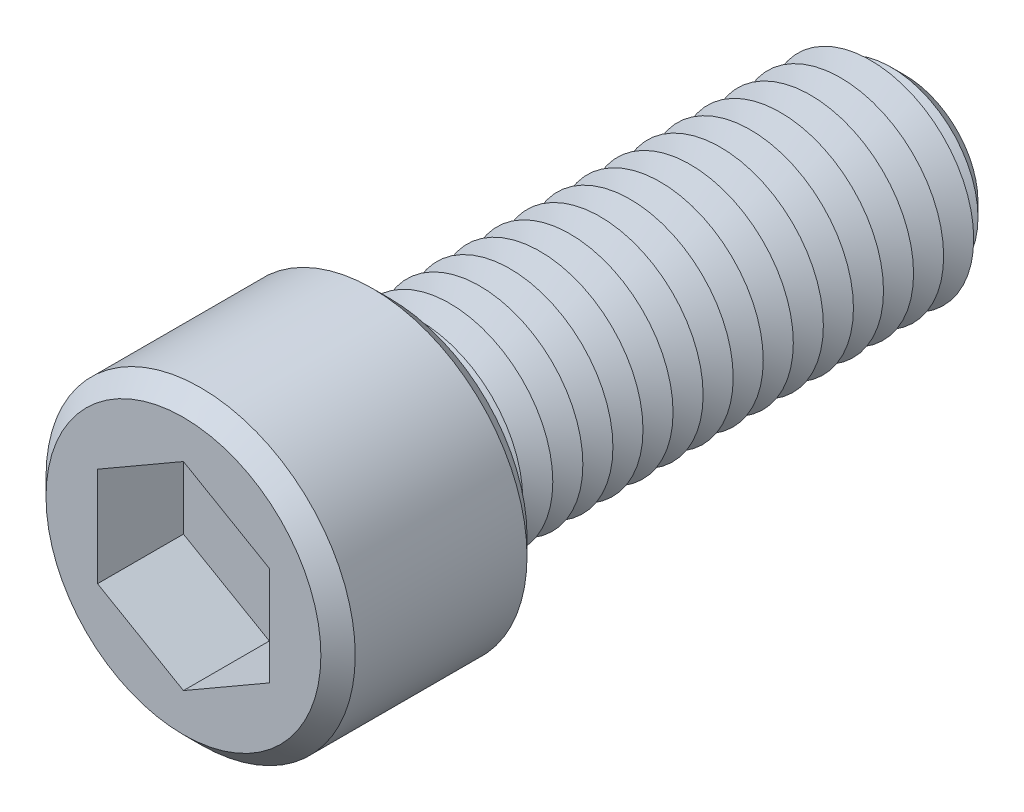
ISO-10303-21;
HEADER;
FILE_DESCRIPTION(('STEP AP214'),'2;1');
FILE_NAME('part.step','',(''),(''),'','','');
FILE_SCHEMA(('AUTOMOTIVE_DESIGN { 1 0 10303 214 1 1 1 1 }'));
ENDSEC;
DATA;
#1=APPLICATION_CONTEXT('core data for automotive mechanical design processes');
#2=APPLICATION_PROTOCOL_DEFINITION('international standard','automotive_design',2000,#1);
#3=PRODUCT_CONTEXT('',#1,'mechanical');
#4=PRODUCT('Part','Part','',(#3));
#5=PRODUCT_RELATED_PRODUCT_CATEGORY('part','',(#4));
#6=PRODUCT_DEFINITION_FORMATION('','',#4);
#7=PRODUCT_DEFINITION_CONTEXT('part definition',#1,'design');
#8=PRODUCT_DEFINITION('design','',#6,#7);
#9=PRODUCT_DEFINITION_SHAPE('','',#8);
#10=(LENGTH_UNIT() NAMED_UNIT(*) SI_UNIT(.MILLI.,.METRE.));
#11=(NAMED_UNIT(*) PLANE_ANGLE_UNIT() SI_UNIT($,.RADIAN.));
#12=(NAMED_UNIT(*) SI_UNIT($,.STERADIAN.) SOLID_ANGLE_UNIT());
#13=UNCERTAINTY_MEASURE_WITH_UNIT(LENGTH_MEASURE(1.E-05),#10,'distance_accuracy_value','');
#14=(GEOMETRIC_REPRESENTATION_CONTEXT(3) GLOBAL_UNCERTAINTY_ASSIGNED_CONTEXT((#13)) GLOBAL_UNIT_ASSIGNED_CONTEXT((#10,
#11,#12)) REPRESENTATION_CONTEXT('',''));
#15=CARTESIAN_POINT('',(0.,0.,0.));
#16=DIRECTION('',(0.,0.,1.));
#17=DIRECTION('',(1.,0.,0.));
#18=AXIS2_PLACEMENT_3D('',#15,#16,#17);
#19=CARTESIAN_POINT('',(0.,0.,12.));
#20=DIRECTION('',(0.,0.,-1.));
#21=DIRECTION('',(-1.,0.,0.));
#22=AXIS2_PLACEMENT_3D('',#19,#20,#21);
#23=CYLINDRICAL_SURFACE('',#22,9.);
#24=CARTESIAN_POINT('',(0.,0.,1.00000000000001));
#25=DIRECTION('',(0.,0.,1.));
#26=DIRECTION('',(1.,0.,0.));
#27=AXIS2_PLACEMENT_3D('',#24,#25,#26);
#28=CIRCLE('',#27,9.);
#29=CARTESIAN_POINT('',(9.,0.,1.00000000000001));
#30=VERTEX_POINT('',#29);
#31=EDGE_CURVE('E312',#30,#30,#28,.T.);
#32=ORIENTED_EDGE('',*,*,#31,.T.);
#33=EDGE_LOOP('',(#32));
#34=FACE_BOUND('',#33,.T.);
#35=CARTESIAN_POINT('',(0.,0.,11.));
#36=DIRECTION('',(0.,0.,1.));
#37=DIRECTION('',(1.,0.,0.));
#38=AXIS2_PLACEMENT_3D('',#35,#36,#37);
#39=CIRCLE('',#38,9.);
#40=CARTESIAN_POINT('',(9.,0.,11.));
#41=VERTEX_POINT('',#40);
#42=EDGE_CURVE('E305',#41,#41,#39,.F.);
#43=ORIENTED_EDGE('',*,*,#42,.T.);
#44=EDGE_LOOP('',(#43));
#45=FACE_BOUND('',#44,.T.);
#46=ADVANCED_FACE('F39',(#34,#45),#23,.T.);
#47=CARTESIAN_POINT('',(0.,0.,12.));
#48=DIRECTION('',(0.,0.,1.));
#49=DIRECTION('',(1.,0.,0.));
#50=AXIS2_PLACEMENT_3D('',#47,#48,#49);
#51=PLANE('',#50);
#52=CARTESIAN_POINT('',(0.,0.,12.));
#53=DIRECTION('',(0.,0.,1.));
#54=DIRECTION('',(1.,0.,0.));
#55=AXIS2_PLACEMENT_3D('',#52,#53,#54);
#56=CIRCLE('',#55,8.00000000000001);
#57=CARTESIAN_POINT('',(8.00000000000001,0.,12.));
#58=VERTEX_POINT('',#57);
#59=EDGE_CURVE('E11',#58,#58,#56,.T.);
#60=ORIENTED_EDGE('',*,*,#59,.T.);
#61=EDGE_LOOP('',(#60));
#62=FACE_BOUND('',#61,.T.);
#63=DIRECTION('',(-0.866025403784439,0.5,0.));
#64=VECTOR('',#63,1.);
#65=CARTESIAN_POINT('',(5.,2.88675134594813,12.));
#66=LINE('',#65,#64);
#67=CARTESIAN_POINT('',(5.,2.88675134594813,12.));
#68=VERTEX_POINT('',#67);
#69=CARTESIAN_POINT('',(0.,5.77350269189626,12.));
#70=VERTEX_POINT('',#69);
#71=EDGE_CURVE('E55',#68,#70,#66,.T.);
#72=ORIENTED_EDGE('',*,*,#71,.F.);
#73=DIRECTION('',(0.,1.,0.));
#74=VECTOR('',#73,1.);
#75=CARTESIAN_POINT('',(5.,-2.88675134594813,12.));
#76=LINE('',#75,#74);
#77=CARTESIAN_POINT('',(5.,-2.88675134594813,12.));
#78=VERTEX_POINT('',#77);
#79=EDGE_CURVE('E151',#78,#68,#76,.T.);
#80=ORIENTED_EDGE('',*,*,#79,.F.);
#81=DIRECTION('',(0.866025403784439,0.5,0.));
#82=VECTOR('',#81,1.);
#83=CARTESIAN_POINT('',(0.,-5.77350269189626,12.));
#84=LINE('',#83,#82);
#85=CARTESIAN_POINT('',(0.,-5.77350269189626,12.));
#86=VERTEX_POINT('',#85);
#87=EDGE_CURVE('E148',#86,#78,#84,.T.);
#88=ORIENTED_EDGE('',*,*,#87,.F.);
#89=DIRECTION('',(0.866025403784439,-0.5,0.));
#90=VECTOR('',#89,1.);
#91=CARTESIAN_POINT('',(-5.,-2.88675134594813,12.));
#92=LINE('',#91,#90);
#93=CARTESIAN_POINT('',(-5.,-2.88675134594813,12.));
#94=VERTEX_POINT('',#93);
#95=EDGE_CURVE('E103',#94,#86,#92,.T.);
#96=ORIENTED_EDGE('',*,*,#95,.F.);
#97=DIRECTION('',(0.,-1.,0.));
#98=VECTOR('',#97,1.);
#99=CARTESIAN_POINT('',(-5.,2.88675134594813,12.));
#100=LINE('',#99,#98);
#101=CARTESIAN_POINT('',(-5.,2.88675134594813,12.));
#102=VERTEX_POINT('',#101);
#103=EDGE_CURVE('E142',#102,#94,#100,.T.);
#104=ORIENTED_EDGE('',*,*,#103,.F.);
#105=DIRECTION('',(-0.866025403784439,-0.5,0.));
#106=VECTOR('',#105,1.);
#107=CARTESIAN_POINT('',(0.,5.77350269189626,12.));
#108=LINE('',#107,#106);
#109=EDGE_CURVE('E137',#70,#102,#108,.T.);
#110=ORIENTED_EDGE('',*,*,#109,.F.);
#111=EDGE_LOOP('',(#72,#80,#88,#96,#104,#110));
#112=FACE_BOUND('',#111,.T.);
#113=ADVANCED_FACE('F330',(#62,#112),#51,.T.);
#114=CARTESIAN_POINT('',(0.,0.,0.));
#115=DIRECTION('',(0.,0.,1.));
#116=DIRECTION('',(1.,0.,0.));
#117=AXIS2_PLACEMENT_3D('',#114,#115,#116);
#118=PLANE('',#117);
#119=CARTESIAN_POINT('',(0.,0.,0.));
#120=DIRECTION('',(0.,0.,1.));
#121=DIRECTION('',(1.,0.,0.));
#122=AXIS2_PLACEMENT_3D('',#119,#120,#121);
#123=CIRCLE('',#122,7.99999999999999);
#124=CARTESIAN_POINT('',(7.99999999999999,0.,0.));
#125=VERTEX_POINT('',#124);
#126=EDGE_CURVE('E48',#125,#125,#123,.F.);
#127=ORIENTED_EDGE('',*,*,#126,.T.);
#128=EDGE_LOOP('',(#127));
#129=FACE_BOUND('',#128,.T.);
#130=CARTESIAN_POINT('',(0.,0.,0.));
#131=DIRECTION('',(0.,0.,1.));
#132=DIRECTION('',(1.,0.,0.));
#133=AXIS2_PLACEMENT_3D('',#130,#131,#132);
#134=CIRCLE('',#133,6.);
#135=CARTESIAN_POINT('',(6.,0.,0.));
#136=VERTEX_POINT('',#135);
#137=EDGE_CURVE('E297',#136,#136,#134,.T.);
#138=ORIENTED_EDGE('',*,*,#137,.T.);
#139=EDGE_LOOP('',(#138));
#140=FACE_BOUND('',#139,.T.);
#141=ADVANCED_FACE('F319',(#129,#140),#118,.F.);
#142=CARTESIAN_POINT('',(0.,0.,0.));
#143=DIRECTION('',(0.,0.,1.));
#144=DIRECTION('',(1.,0.,0.));
#145=AXIS2_PLACEMENT_3D('',#142,#143,#144);
#146=CONICAL_SURFACE('',#145,6.,1.0471975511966);
#147=CARTESIAN_POINT('',(0.,0.,-0.875));
#148=DIRECTION('',(0.,0.,1.));
#149=DIRECTION('',(1.,0.,0.));
#150=AXIS2_PLACEMENT_3D('',#147,#148,#149);
#151=CIRCLE('',#150,4.48445554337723);
#152=CARTESIAN_POINT('',(4.48445554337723,0.,-0.875));
#153=VERTEX_POINT('',#152);
#154=EDGE_CURVE('E293',#153,#153,#151,.T.);
#155=ORIENTED_EDGE('',*,*,#154,.T.);
#156=EDGE_LOOP('',(#155));
#157=FACE_BOUND('',#156,.T.);
#158=ORIENTED_EDGE('',*,*,#137,.F.);
#159=EDGE_LOOP('',(#158));
#160=FACE_BOUND('',#159,.T.);
#161=ADVANCED_FACE('F516',(#157,#160),#146,.T.);
#162=CARTESIAN_POINT('',(0.,0.,-0.875));
#163=DIRECTION('',(0.,0.,-1.));
#164=DIRECTION('',(-1.,0.,0.));
#165=AXIS2_PLACEMENT_3D('',#162,#163,#164);
#166=CONICAL_SURFACE('',#165,4.48445554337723,1.0471975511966);
#167=CARTESIAN_POINT('',(0.,0.,-1.75));
#168=DIRECTION('',(0.,0.,1.));
#169=DIRECTION('',(1.,0.,0.));
#170=AXIS2_PLACEMENT_3D('',#167,#168,#169);
#171=CIRCLE('',#170,6.);
#172=CARTESIAN_POINT('',(6.,0.,-1.75));
#173=VERTEX_POINT('',#172);
#174=EDGE_CURVE('E289',#173,#173,#171,.T.);
#175=ORIENTED_EDGE('',*,*,#174,.T.);
#176=EDGE_LOOP('',(#175));
#177=FACE_BOUND('',#176,.T.);
#178=ORIENTED_EDGE('',*,*,#154,.F.);
#179=EDGE_LOOP('',(#178));
#180=FACE_BOUND('',#179,.T.);
#181=ADVANCED_FACE('F512',(#177,#180),#166,.T.);
#182=CARTESIAN_POINT('',(0.,0.,-1.75));
#183=DIRECTION('',(0.,0.,1.));
#184=DIRECTION('',(1.,0.,0.));
#185=AXIS2_PLACEMENT_3D('',#182,#183,#184);
#186=CONICAL_SURFACE('',#185,6.,1.0471975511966);
#187=CARTESIAN_POINT('',(0.,0.,-2.625));
#188=DIRECTION('',(0.,0.,1.));
#189=DIRECTION('',(1.,0.,0.));
#190=AXIS2_PLACEMENT_3D('',#187,#188,#189);
#191=CIRCLE('',#190,4.48445554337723);
#192=CARTESIAN_POINT('',(4.48445554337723,0.,-2.625));
#193=VERTEX_POINT('',#192);
#194=EDGE_CURVE('E285',#193,#193,#191,.T.);
#195=ORIENTED_EDGE('',*,*,#194,.T.);
#196=EDGE_LOOP('',(#195));
#197=FACE_BOUND('',#196,.T.);
#198=ORIENTED_EDGE('',*,*,#174,.F.);
#199=EDGE_LOOP('',(#198));
#200=FACE_BOUND('',#199,.T.);
#201=ADVANCED_FACE('F508',(#197,#200),#186,.T.);
#202=CARTESIAN_POINT('',(0.,0.,-2.625));
#203=DIRECTION('',(0.,0.,-1.));
#204=DIRECTION('',(-1.,0.,0.));
#205=AXIS2_PLACEMENT_3D('',#202,#203,#204);
#206=CONICAL_SURFACE('',#205,4.48445554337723,1.0471975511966);
#207=CARTESIAN_POINT('',(0.,0.,-3.5));
#208=DIRECTION('',(0.,0.,1.));
#209=DIRECTION('',(1.,0.,0.));
#210=AXIS2_PLACEMENT_3D('',#207,#208,#209);
#211=CIRCLE('',#210,6.);
#212=CARTESIAN_POINT('',(6.,0.,-3.5));
#213=VERTEX_POINT('',#212);
#214=EDGE_CURVE('E281',#213,#213,#211,.T.);
#215=ORIENTED_EDGE('',*,*,#214,.T.);
#216=EDGE_LOOP('',(#215));
#217=FACE_BOUND('',#216,.T.);
#218=ORIENTED_EDGE('',*,*,#194,.F.);
#219=EDGE_LOOP('',(#218));
#220=FACE_BOUND('',#219,.T.);
#221=ADVANCED_FACE('F504',(#217,#220),#206,.T.);
#222=CARTESIAN_POINT('',(0.,0.,-3.5));
#223=DIRECTION('',(0.,0.,1.));
#224=DIRECTION('',(1.,0.,0.));
#225=AXIS2_PLACEMENT_3D('',#222,#223,#224);
#226=CONICAL_SURFACE('',#225,6.,1.0471975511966);
#227=CARTESIAN_POINT('',(0.,0.,-4.375));
#228=DIRECTION('',(0.,0.,1.));
#229=DIRECTION('',(1.,0.,0.));
#230=AXIS2_PLACEMENT_3D('',#227,#228,#229);
#231=CIRCLE('',#230,4.48445554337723);
#232=CARTESIAN_POINT('',(4.48445554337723,0.,-4.375));
#233=VERTEX_POINT('',#232);
#234=EDGE_CURVE('E277',#233,#233,#231,.T.);
#235=ORIENTED_EDGE('',*,*,#234,.T.);
#236=EDGE_LOOP('',(#235));
#237=FACE_BOUND('',#236,.T.);
#238=ORIENTED_EDGE('',*,*,#214,.F.);
#239=EDGE_LOOP('',(#238));
#240=FACE_BOUND('',#239,.T.);
#241=ADVANCED_FACE('F500',(#237,#240),#226,.T.);
#242=CARTESIAN_POINT('',(0.,0.,-4.375));
#243=DIRECTION('',(0.,0.,-1.));
#244=DIRECTION('',(-1.,0.,0.));
#245=AXIS2_PLACEMENT_3D('',#242,#243,#244);
#246=CONICAL_SURFACE('',#245,4.48445554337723,1.0471975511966);
#247=CARTESIAN_POINT('',(0.,0.,-5.25));
#248=DIRECTION('',(0.,0.,1.));
#249=DIRECTION('',(1.,0.,0.));
#250=AXIS2_PLACEMENT_3D('',#247,#248,#249);
#251=CIRCLE('',#250,6.);
#252=CARTESIAN_POINT('',(6.,0.,-5.25));
#253=VERTEX_POINT('',#252);
#254=EDGE_CURVE('E273',#253,#253,#251,.T.);
#255=ORIENTED_EDGE('',*,*,#254,.T.);
#256=EDGE_LOOP('',(#255));
#257=FACE_BOUND('',#256,.T.);
#258=ORIENTED_EDGE('',*,*,#234,.F.);
#259=EDGE_LOOP('',(#258));
#260=FACE_BOUND('',#259,.T.);
#261=ADVANCED_FACE('F496',(#257,#260),#246,.T.);
#262=CARTESIAN_POINT('',(0.,0.,-5.25));
#263=DIRECTION('',(0.,0.,1.));
#264=DIRECTION('',(1.,0.,0.));
#265=AXIS2_PLACEMENT_3D('',#262,#263,#264);
#266=CONICAL_SURFACE('',#265,6.,1.0471975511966);
#267=CARTESIAN_POINT('',(0.,0.,-6.125));
#268=DIRECTION('',(0.,0.,1.));
#269=DIRECTION('',(1.,0.,0.));
#270=AXIS2_PLACEMENT_3D('',#267,#268,#269);
#271=CIRCLE('',#270,4.48445554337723);
#272=CARTESIAN_POINT('',(4.48445554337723,0.,-6.125));
#273=VERTEX_POINT('',#272);
#274=EDGE_CURVE('E269',#273,#273,#271,.T.);
#275=ORIENTED_EDGE('',*,*,#274,.T.);
#276=EDGE_LOOP('',(#275));
#277=FACE_BOUND('',#276,.T.);
#278=ORIENTED_EDGE('',*,*,#254,.F.);
#279=EDGE_LOOP('',(#278));
#280=FACE_BOUND('',#279,.T.);
#281=ADVANCED_FACE('F492',(#277,#280),#266,.T.);
#282=CARTESIAN_POINT('',(0.,0.,-6.125));
#283=DIRECTION('',(0.,0.,-1.));
#284=DIRECTION('',(-1.,0.,0.));
#285=AXIS2_PLACEMENT_3D('',#282,#283,#284);
#286=CONICAL_SURFACE('',#285,4.48445554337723,1.0471975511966);
#287=CARTESIAN_POINT('',(0.,0.,-7.));
#288=DIRECTION('',(0.,0.,1.));
#289=DIRECTION('',(1.,0.,0.));
#290=AXIS2_PLACEMENT_3D('',#287,#288,#289);
#291=CIRCLE('',#290,6.);
#292=CARTESIAN_POINT('',(6.,0.,-7.));
#293=VERTEX_POINT('',#292);
#294=EDGE_CURVE('E265',#293,#293,#291,.T.);
#295=ORIENTED_EDGE('',*,*,#294,.T.);
#296=EDGE_LOOP('',(#295));
#297=FACE_BOUND('',#296,.T.);
#298=ORIENTED_EDGE('',*,*,#274,.F.);
#299=EDGE_LOOP('',(#298));
#300=FACE_BOUND('',#299,.T.);
#301=ADVANCED_FACE('F488',(#297,#300),#286,.T.);
#302=CARTESIAN_POINT('',(0.,0.,-7.));
#303=DIRECTION('',(0.,0.,1.));
#304=DIRECTION('',(1.,0.,0.));
#305=AXIS2_PLACEMENT_3D('',#302,#303,#304);
#306=CONICAL_SURFACE('',#305,6.,1.0471975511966);
#307=CARTESIAN_POINT('',(0.,0.,-7.875));
#308=DIRECTION('',(0.,0.,1.));
#309=DIRECTION('',(1.,0.,0.));
#310=AXIS2_PLACEMENT_3D('',#307,#308,#309);
#311=CIRCLE('',#310,4.48445554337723);
#312=CARTESIAN_POINT('',(4.48445554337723,0.,-7.875));
#313=VERTEX_POINT('',#312);
#314=EDGE_CURVE('E261',#313,#313,#311,.T.);
#315=ORIENTED_EDGE('',*,*,#314,.T.);
#316=EDGE_LOOP('',(#315));
#317=FACE_BOUND('',#316,.T.);
#318=ORIENTED_EDGE('',*,*,#294,.F.);
#319=EDGE_LOOP('',(#318));
#320=FACE_BOUND('',#319,.T.);
#321=ADVANCED_FACE('F484',(#317,#320),#306,.T.);
#322=CARTESIAN_POINT('',(0.,0.,-7.875));
#323=DIRECTION('',(0.,0.,-1.));
#324=DIRECTION('',(-1.,0.,0.));
#325=AXIS2_PLACEMENT_3D('',#322,#323,#324);
#326=CONICAL_SURFACE('',#325,4.48445554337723,1.0471975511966);
#327=CARTESIAN_POINT('',(0.,0.,-8.75));
#328=DIRECTION('',(0.,0.,1.));
#329=DIRECTION('',(1.,0.,0.));
#330=AXIS2_PLACEMENT_3D('',#327,#328,#329);
#331=CIRCLE('',#330,6.);
#332=CARTESIAN_POINT('',(6.,0.,-8.75));
#333=VERTEX_POINT('',#332);
#334=EDGE_CURVE('E257',#333,#333,#331,.T.);
#335=ORIENTED_EDGE('',*,*,#334,.T.);
#336=EDGE_LOOP('',(#335));
#337=FACE_BOUND('',#336,.T.);
#338=ORIENTED_EDGE('',*,*,#314,.F.);
#339=EDGE_LOOP('',(#338));
#340=FACE_BOUND('',#339,.T.);
#341=ADVANCED_FACE('F480',(#337,#340),#326,.T.);
#342=CARTESIAN_POINT('',(0.,0.,-8.75));
#343=DIRECTION('',(0.,0.,1.));
#344=DIRECTION('',(1.,0.,0.));
#345=AXIS2_PLACEMENT_3D('',#342,#343,#344);
#346=CONICAL_SURFACE('',#345,6.,1.0471975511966);
#347=CARTESIAN_POINT('',(0.,0.,-9.625));
#348=DIRECTION('',(0.,0.,1.));
#349=DIRECTION('',(1.,0.,0.));
#350=AXIS2_PLACEMENT_3D('',#347,#348,#349);
#351=CIRCLE('',#350,4.48445554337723);
#352=CARTESIAN_POINT('',(4.48445554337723,0.,-9.625));
#353=VERTEX_POINT('',#352);
#354=EDGE_CURVE('E253',#353,#353,#351,.T.);
#355=ORIENTED_EDGE('',*,*,#354,.T.);
#356=EDGE_LOOP('',(#355));
#357=FACE_BOUND('',#356,.T.);
#358=ORIENTED_EDGE('',*,*,#334,.F.);
#359=EDGE_LOOP('',(#358));
#360=FACE_BOUND('',#359,.T.);
#361=ADVANCED_FACE('F476',(#357,#360),#346,.T.);
#362=CARTESIAN_POINT('',(0.,0.,-9.625));
#363=DIRECTION('',(0.,0.,-1.));
#364=DIRECTION('',(-1.,0.,0.));
#365=AXIS2_PLACEMENT_3D('',#362,#363,#364);
#366=CONICAL_SURFACE('',#365,4.48445554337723,1.0471975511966);
#367=CARTESIAN_POINT('',(0.,0.,-10.5));
#368=DIRECTION('',(0.,0.,1.));
#369=DIRECTION('',(1.,0.,0.));
#370=AXIS2_PLACEMENT_3D('',#367,#368,#369);
#371=CIRCLE('',#370,6.);
#372=CARTESIAN_POINT('',(6.,0.,-10.5));
#373=VERTEX_POINT('',#372);
#374=EDGE_CURVE('E249',#373,#373,#371,.T.);
#375=ORIENTED_EDGE('',*,*,#374,.T.);
#376=EDGE_LOOP('',(#375));
#377=FACE_BOUND('',#376,.T.);
#378=ORIENTED_EDGE('',*,*,#354,.F.);
#379=EDGE_LOOP('',(#378));
#380=FACE_BOUND('',#379,.T.);
#381=ADVANCED_FACE('F472',(#377,#380),#366,.T.);
#382=CARTESIAN_POINT('',(0.,0.,-10.5));
#383=DIRECTION('',(0.,0.,1.));
#384=DIRECTION('',(1.,0.,0.));
#385=AXIS2_PLACEMENT_3D('',#382,#383,#384);
#386=CONICAL_SURFACE('',#385,6.,1.0471975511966);
#387=CARTESIAN_POINT('',(0.,0.,-11.375));
#388=DIRECTION('',(0.,0.,1.));
#389=DIRECTION('',(1.,0.,0.));
#390=AXIS2_PLACEMENT_3D('',#387,#388,#389);
#391=CIRCLE('',#390,4.48445554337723);
#392=CARTESIAN_POINT('',(4.48445554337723,0.,-11.375));
#393=VERTEX_POINT('',#392);
#394=EDGE_CURVE('E245',#393,#393,#391,.T.);
#395=ORIENTED_EDGE('',*,*,#394,.T.);
#396=EDGE_LOOP('',(#395));
#397=FACE_BOUND('',#396,.T.);
#398=ORIENTED_EDGE('',*,*,#374,.F.);
#399=EDGE_LOOP('',(#398));
#400=FACE_BOUND('',#399,.T.);
#401=ADVANCED_FACE('F468',(#397,#400),#386,.T.);
#402=CARTESIAN_POINT('',(0.,0.,-11.375));
#403=DIRECTION('',(0.,0.,-1.));
#404=DIRECTION('',(-1.,0.,0.));
#405=AXIS2_PLACEMENT_3D('',#402,#403,#404);
#406=CONICAL_SURFACE('',#405,4.48445554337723,1.0471975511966);
#407=CARTESIAN_POINT('',(0.,0.,-12.25));
#408=DIRECTION('',(0.,0.,1.));
#409=DIRECTION('',(1.,0.,0.));
#410=AXIS2_PLACEMENT_3D('',#407,#408,#409);
#411=CIRCLE('',#410,6.);
#412=CARTESIAN_POINT('',(6.,0.,-12.25));
#413=VERTEX_POINT('',#412);
#414=EDGE_CURVE('E241',#413,#413,#411,.T.);
#415=ORIENTED_EDGE('',*,*,#414,.T.);
#416=EDGE_LOOP('',(#415));
#417=FACE_BOUND('',#416,.T.);
#418=ORIENTED_EDGE('',*,*,#394,.F.);
#419=EDGE_LOOP('',(#418));
#420=FACE_BOUND('',#419,.T.);
#421=ADVANCED_FACE('F464',(#417,#420),#406,.T.);
#422=CARTESIAN_POINT('',(0.,0.,-12.25));
#423=DIRECTION('',(0.,0.,1.));
#424=DIRECTION('',(1.,0.,0.));
#425=AXIS2_PLACEMENT_3D('',#422,#423,#424);
#426=CONICAL_SURFACE('',#425,6.,1.0471975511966);
#427=CARTESIAN_POINT('',(0.,0.,-13.125));
#428=DIRECTION('',(0.,0.,1.));
#429=DIRECTION('',(1.,0.,0.));
#430=AXIS2_PLACEMENT_3D('',#427,#428,#429);
#431=CIRCLE('',#430,4.48445554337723);
#432=CARTESIAN_POINT('',(4.48445554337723,0.,-13.125));
#433=VERTEX_POINT('',#432);
#434=EDGE_CURVE('E237',#433,#433,#431,.T.);
#435=ORIENTED_EDGE('',*,*,#434,.T.);
#436=EDGE_LOOP('',(#435));
#437=FACE_BOUND('',#436,.T.);
#438=ORIENTED_EDGE('',*,*,#414,.F.);
#439=EDGE_LOOP('',(#438));
#440=FACE_BOUND('',#439,.T.);
#441=ADVANCED_FACE('F460',(#437,#440),#426,.T.);
#442=CARTESIAN_POINT('',(0.,0.,-13.125));
#443=DIRECTION('',(0.,0.,-1.));
#444=DIRECTION('',(-1.,0.,0.));
#445=AXIS2_PLACEMENT_3D('',#442,#443,#444);
#446=CONICAL_SURFACE('',#445,4.48445554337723,1.0471975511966);
#447=CARTESIAN_POINT('',(0.,0.,-14.));
#448=DIRECTION('',(0.,0.,1.));
#449=DIRECTION('',(1.,0.,0.));
#450=AXIS2_PLACEMENT_3D('',#447,#448,#449);
#451=CIRCLE('',#450,6.);
#452=CARTESIAN_POINT('',(6.,0.,-14.));
#453=VERTEX_POINT('',#452);
#454=EDGE_CURVE('E233',#453,#453,#451,.T.);
#455=ORIENTED_EDGE('',*,*,#454,.T.);
#456=EDGE_LOOP('',(#455));
#457=FACE_BOUND('',#456,.T.);
#458=ORIENTED_EDGE('',*,*,#434,.F.);
#459=EDGE_LOOP('',(#458));
#460=FACE_BOUND('',#459,.T.);
#461=ADVANCED_FACE('F456',(#457,#460),#446,.T.);
#462=CARTESIAN_POINT('',(0.,0.,-14.));
#463=DIRECTION('',(0.,0.,1.));
#464=DIRECTION('',(1.,0.,0.));
#465=AXIS2_PLACEMENT_3D('',#462,#463,#464);
#466=CONICAL_SURFACE('',#465,6.,1.0471975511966);
#467=CARTESIAN_POINT('',(0.,0.,-14.875));
#468=DIRECTION('',(0.,0.,1.));
#469=DIRECTION('',(1.,0.,0.));
#470=AXIS2_PLACEMENT_3D('',#467,#468,#469);
#471=CIRCLE('',#470,4.48445554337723);
#472=CARTESIAN_POINT('',(4.48445554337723,0.,-14.875));
#473=VERTEX_POINT('',#472);
#474=EDGE_CURVE('E229',#473,#473,#471,.T.);
#475=ORIENTED_EDGE('',*,*,#474,.T.);
#476=EDGE_LOOP('',(#475));
#477=FACE_BOUND('',#476,.T.);
#478=ORIENTED_EDGE('',*,*,#454,.F.);
#479=EDGE_LOOP('',(#478));
#480=FACE_BOUND('',#479,.T.);
#481=ADVANCED_FACE('F452',(#477,#480),#466,.T.);
#482=CARTESIAN_POINT('',(0.,0.,-14.875));
#483=DIRECTION('',(0.,0.,-1.));
#484=DIRECTION('',(-1.,0.,0.));
#485=AXIS2_PLACEMENT_3D('',#482,#483,#484);
#486=CONICAL_SURFACE('',#485,4.48445554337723,1.0471975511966);
#487=CARTESIAN_POINT('',(0.,0.,-15.75));
#488=DIRECTION('',(0.,0.,1.));
#489=DIRECTION('',(1.,0.,0.));
#490=AXIS2_PLACEMENT_3D('',#487,#488,#489);
#491=CIRCLE('',#490,6.);
#492=CARTESIAN_POINT('',(6.,0.,-15.75));
#493=VERTEX_POINT('',#492);
#494=EDGE_CURVE('E225',#493,#493,#491,.T.);
#495=ORIENTED_EDGE('',*,*,#494,.T.);
#496=EDGE_LOOP('',(#495));
#497=FACE_BOUND('',#496,.T.);
#498=ORIENTED_EDGE('',*,*,#474,.F.);
#499=EDGE_LOOP('',(#498));
#500=FACE_BOUND('',#499,.T.);
#501=ADVANCED_FACE('F448',(#497,#500),#486,.T.);
#502=CARTESIAN_POINT('',(0.,0.,-15.75));
#503=DIRECTION('',(0.,0.,1.));
#504=DIRECTION('',(1.,0.,0.));
#505=AXIS2_PLACEMENT_3D('',#502,#503,#504);
#506=CONICAL_SURFACE('',#505,6.,1.0471975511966);
#507=CARTESIAN_POINT('',(0.,0.,-16.625));
#508=DIRECTION('',(0.,0.,1.));
#509=DIRECTION('',(1.,0.,0.));
#510=AXIS2_PLACEMENT_3D('',#507,#508,#509);
#511=CIRCLE('',#510,4.48445554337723);
#512=CARTESIAN_POINT('',(4.48445554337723,0.,-16.625));
#513=VERTEX_POINT('',#512);
#514=EDGE_CURVE('E221',#513,#513,#511,.T.);
#515=ORIENTED_EDGE('',*,*,#514,.T.);
#516=EDGE_LOOP('',(#515));
#517=FACE_BOUND('',#516,.T.);
#518=ORIENTED_EDGE('',*,*,#494,.F.);
#519=EDGE_LOOP('',(#518));
#520=FACE_BOUND('',#519,.T.);
#521=ADVANCED_FACE('F444',(#517,#520),#506,.T.);
#522=CARTESIAN_POINT('',(0.,0.,-16.625));
#523=DIRECTION('',(0.,0.,-1.));
#524=DIRECTION('',(-1.,0.,0.));
#525=AXIS2_PLACEMENT_3D('',#522,#523,#524);
#526=CONICAL_SURFACE('',#525,4.48445554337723,1.0471975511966);
#527=CARTESIAN_POINT('',(0.,0.,-17.5));
#528=DIRECTION('',(0.,0.,1.));
#529=DIRECTION('',(1.,0.,0.));
#530=AXIS2_PLACEMENT_3D('',#527,#528,#529);
#531=CIRCLE('',#530,6.);
#532=CARTESIAN_POINT('',(6.,0.,-17.5));
#533=VERTEX_POINT('',#532);
#534=EDGE_CURVE('E217',#533,#533,#531,.T.);
#535=ORIENTED_EDGE('',*,*,#534,.T.);
#536=EDGE_LOOP('',(#535));
#537=FACE_BOUND('',#536,.T.);
#538=ORIENTED_EDGE('',*,*,#514,.F.);
#539=EDGE_LOOP('',(#538));
#540=FACE_BOUND('',#539,.T.);
#541=ADVANCED_FACE('F440',(#537,#540),#526,.T.);
#542=CARTESIAN_POINT('',(0.,0.,-17.5));
#543=DIRECTION('',(0.,0.,1.));
#544=DIRECTION('',(1.,0.,0.));
#545=AXIS2_PLACEMENT_3D('',#542,#543,#544);
#546=CONICAL_SURFACE('',#545,6.,1.0471975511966);
#547=CARTESIAN_POINT('',(0.,0.,-18.375));
#548=DIRECTION('',(0.,0.,1.));
#549=DIRECTION('',(1.,0.,0.));
#550=AXIS2_PLACEMENT_3D('',#547,#548,#549);
#551=CIRCLE('',#550,4.48445554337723);
#552=CARTESIAN_POINT('',(4.48445554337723,0.,-18.375));
#553=VERTEX_POINT('',#552);
#554=EDGE_CURVE('E213',#553,#553,#551,.T.);
#555=ORIENTED_EDGE('',*,*,#554,.T.);
#556=EDGE_LOOP('',(#555));
#557=FACE_BOUND('',#556,.T.);
#558=ORIENTED_EDGE('',*,*,#534,.F.);
#559=EDGE_LOOP('',(#558));
#560=FACE_BOUND('',#559,.T.);
#561=ADVANCED_FACE('F436',(#557,#560),#546,.T.);
#562=CARTESIAN_POINT('',(0.,0.,-18.375));
#563=DIRECTION('',(0.,0.,-1.));
#564=DIRECTION('',(-1.,0.,0.));
#565=AXIS2_PLACEMENT_3D('',#562,#563,#564);
#566=CONICAL_SURFACE('',#565,4.48445554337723,1.0471975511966);
#567=CARTESIAN_POINT('',(0.,0.,-19.25));
#568=DIRECTION('',(0.,0.,1.));
#569=DIRECTION('',(1.,0.,0.));
#570=AXIS2_PLACEMENT_3D('',#567,#568,#569);
#571=CIRCLE('',#570,6.);
#572=CARTESIAN_POINT('',(6.,0.,-19.25));
#573=VERTEX_POINT('',#572);
#574=EDGE_CURVE('E209',#573,#573,#571,.T.);
#575=ORIENTED_EDGE('',*,*,#574,.T.);
#576=EDGE_LOOP('',(#575));
#577=FACE_BOUND('',#576,.T.);
#578=ORIENTED_EDGE('',*,*,#554,.F.);
#579=EDGE_LOOP('',(#578));
#580=FACE_BOUND('',#579,.T.);
#581=ADVANCED_FACE('F432',(#577,#580),#566,.T.);
#582=CARTESIAN_POINT('',(0.,0.,-19.25));
#583=DIRECTION('',(0.,0.,1.));
#584=DIRECTION('',(1.,0.,0.));
#585=AXIS2_PLACEMENT_3D('',#582,#583,#584);
#586=CONICAL_SURFACE('',#585,6.,1.0471975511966);
#587=CARTESIAN_POINT('',(0.,0.,-20.125));
#588=DIRECTION('',(0.,0.,1.));
#589=DIRECTION('',(1.,0.,0.));
#590=AXIS2_PLACEMENT_3D('',#587,#588,#589);
#591=CIRCLE('',#590,4.48445554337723);
#592=CARTESIAN_POINT('',(4.48445554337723,0.,-20.125));
#593=VERTEX_POINT('',#592);
#594=EDGE_CURVE('E205',#593,#593,#591,.T.);
#595=ORIENTED_EDGE('',*,*,#594,.T.);
#596=EDGE_LOOP('',(#595));
#597=FACE_BOUND('',#596,.T.);
#598=ORIENTED_EDGE('',*,*,#574,.F.);
#599=EDGE_LOOP('',(#598));
#600=FACE_BOUND('',#599,.T.);
#601=ADVANCED_FACE('F428',(#597,#600),#586,.T.);
#602=CARTESIAN_POINT('',(0.,0.,-20.125));
#603=DIRECTION('',(0.,0.,-1.));
#604=DIRECTION('',(-1.,0.,0.));
#605=AXIS2_PLACEMENT_3D('',#602,#603,#604);
#606=CONICAL_SURFACE('',#605,4.48445554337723,1.0471975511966);
#607=CARTESIAN_POINT('',(0.,0.,-21.));
#608=DIRECTION('',(0.,0.,1.));
#609=DIRECTION('',(1.,0.,0.));
#610=AXIS2_PLACEMENT_3D('',#607,#608,#609);
#611=CIRCLE('',#610,6.);
#612=CARTESIAN_POINT('',(6.,0.,-21.));
#613=VERTEX_POINT('',#612);
#614=EDGE_CURVE('E201',#613,#613,#611,.T.);
#615=ORIENTED_EDGE('',*,*,#614,.T.);
#616=EDGE_LOOP('',(#615));
#617=FACE_BOUND('',#616,.T.);
#618=ORIENTED_EDGE('',*,*,#594,.F.);
#619=EDGE_LOOP('',(#618));
#620=FACE_BOUND('',#619,.T.);
#621=ADVANCED_FACE('F424',(#617,#620),#606,.T.);
#622=CARTESIAN_POINT('',(0.,0.,-21.));
#623=DIRECTION('',(0.,0.,1.));
#624=DIRECTION('',(1.,0.,0.));
#625=AXIS2_PLACEMENT_3D('',#622,#623,#624);
#626=CONICAL_SURFACE('',#625,6.,1.0471975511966);
#627=CARTESIAN_POINT('',(0.,0.,-21.875));
#628=DIRECTION('',(0.,0.,1.));
#629=DIRECTION('',(1.,0.,0.));
#630=AXIS2_PLACEMENT_3D('',#627,#628,#629);
#631=CIRCLE('',#630,4.48445554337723);
#632=CARTESIAN_POINT('',(4.48445554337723,0.,-21.875));
#633=VERTEX_POINT('',#632);
#634=EDGE_CURVE('E197',#633,#633,#631,.T.);
#635=ORIENTED_EDGE('',*,*,#634,.T.);
#636=EDGE_LOOP('',(#635));
#637=FACE_BOUND('',#636,.T.);
#638=ORIENTED_EDGE('',*,*,#614,.F.);
#639=EDGE_LOOP('',(#638));
#640=FACE_BOUND('',#639,.T.);
#641=ADVANCED_FACE('F420',(#637,#640),#626,.T.);
#642=CARTESIAN_POINT('',(0.,0.,-21.875));
#643=DIRECTION('',(0.,0.,-1.));
#644=DIRECTION('',(-1.,0.,0.));
#645=AXIS2_PLACEMENT_3D('',#642,#643,#644);
#646=CONICAL_SURFACE('',#645,4.48445554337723,1.0471975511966);
#647=CARTESIAN_POINT('',(0.,0.,-22.75));
#648=DIRECTION('',(0.,0.,1.));
#649=DIRECTION('',(1.,0.,0.));
#650=AXIS2_PLACEMENT_3D('',#647,#648,#649);
#651=CIRCLE('',#650,6.);
#652=CARTESIAN_POINT('',(6.,0.,-22.75));
#653=VERTEX_POINT('',#652);
#654=EDGE_CURVE('E193',#653,#653,#651,.T.);
#655=ORIENTED_EDGE('',*,*,#654,.T.);
#656=EDGE_LOOP('',(#655));
#657=FACE_BOUND('',#656,.T.);
#658=ORIENTED_EDGE('',*,*,#634,.F.);
#659=EDGE_LOOP('',(#658));
#660=FACE_BOUND('',#659,.T.);
#661=ADVANCED_FACE('F416',(#657,#660),#646,.T.);
#662=CARTESIAN_POINT('',(0.,0.,-22.75));
#663=DIRECTION('',(0.,0.,1.));
#664=DIRECTION('',(1.,0.,0.));
#665=AXIS2_PLACEMENT_3D('',#662,#663,#664);
#666=CONICAL_SURFACE('',#665,6.,1.0471975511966);
#667=CARTESIAN_POINT('',(0.,0.,-23.625));
#668=DIRECTION('',(0.,0.,1.));
#669=DIRECTION('',(1.,0.,0.));
#670=AXIS2_PLACEMENT_3D('',#667,#668,#669);
#671=CIRCLE('',#670,4.48445554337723);
#672=CARTESIAN_POINT('',(4.48445554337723,0.,-23.625));
#673=VERTEX_POINT('',#672);
#674=EDGE_CURVE('E189',#673,#673,#671,.T.);
#675=ORIENTED_EDGE('',*,*,#674,.T.);
#676=EDGE_LOOP('',(#675));
#677=FACE_BOUND('',#676,.T.);
#678=ORIENTED_EDGE('',*,*,#654,.F.);
#679=EDGE_LOOP('',(#678));
#680=FACE_BOUND('',#679,.T.);
#681=ADVANCED_FACE('F412',(#677,#680),#666,.T.);
#682=CARTESIAN_POINT('',(0.,0.,-23.625));
#683=DIRECTION('',(0.,0.,-1.));
#684=DIRECTION('',(-1.,0.,0.));
#685=AXIS2_PLACEMENT_3D('',#682,#683,#684);
#686=CONICAL_SURFACE('',#685,4.48445554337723,1.0471975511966);
#687=CARTESIAN_POINT('',(0.,0.,-24.5));
#688=DIRECTION('',(0.,0.,1.));
#689=DIRECTION('',(1.,0.,0.));
#690=AXIS2_PLACEMENT_3D('',#687,#688,#689);
#691=CIRCLE('',#690,6.);
#692=CARTESIAN_POINT('',(6.,0.,-24.5));
#693=VERTEX_POINT('',#692);
#694=EDGE_CURVE('E185',#693,#693,#691,.T.);
#695=ORIENTED_EDGE('',*,*,#694,.T.);
#696=EDGE_LOOP('',(#695));
#697=FACE_BOUND('',#696,.T.);
#698=ORIENTED_EDGE('',*,*,#674,.F.);
#699=EDGE_LOOP('',(#698));
#700=FACE_BOUND('',#699,.T.);
#701=ADVANCED_FACE('F408',(#697,#700),#686,.T.);
#702=CARTESIAN_POINT('',(0.,0.,-24.5));
#703=DIRECTION('',(0.,0.,1.));
#704=DIRECTION('',(1.,0.,0.));
#705=AXIS2_PLACEMENT_3D('',#702,#703,#704);
#706=CONICAL_SURFACE('',#705,6.,1.0471975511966);
#707=CARTESIAN_POINT('',(0.,0.,-25.375));
#708=DIRECTION('',(0.,0.,1.));
#709=DIRECTION('',(1.,0.,0.));
#710=AXIS2_PLACEMENT_3D('',#707,#708,#709);
#711=CIRCLE('',#710,4.48445554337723);
#712=CARTESIAN_POINT('',(4.48445554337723,0.,-25.375));
#713=VERTEX_POINT('',#712);
#714=EDGE_CURVE('E181',#713,#713,#711,.T.);
#715=ORIENTED_EDGE('',*,*,#714,.T.);
#716=EDGE_LOOP('',(#715));
#717=FACE_BOUND('',#716,.T.);
#718=ORIENTED_EDGE('',*,*,#694,.F.);
#719=EDGE_LOOP('',(#718));
#720=FACE_BOUND('',#719,.T.);
#721=ADVANCED_FACE('F404',(#717,#720),#706,.T.);
#722=CARTESIAN_POINT('',(0.,0.,-25.375));
#723=DIRECTION('',(0.,0.,-1.));
#724=DIRECTION('',(-1.,0.,0.));
#725=AXIS2_PLACEMENT_3D('',#722,#723,#724);
#726=CONICAL_SURFACE('',#725,4.48445554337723,1.0471975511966);
#727=CARTESIAN_POINT('',(0.,0.,-26.25));
#728=DIRECTION('',(0.,0.,1.));
#729=DIRECTION('',(1.,0.,0.));
#730=AXIS2_PLACEMENT_3D('',#727,#728,#729);
#731=CIRCLE('',#730,6.);
#732=CARTESIAN_POINT('',(6.,0.,-26.25));
#733=VERTEX_POINT('',#732);
#734=EDGE_CURVE('E177',#733,#733,#731,.T.);
#735=ORIENTED_EDGE('',*,*,#734,.T.);
#736=EDGE_LOOP('',(#735));
#737=FACE_BOUND('',#736,.T.);
#738=ORIENTED_EDGE('',*,*,#714,.F.);
#739=EDGE_LOOP('',(#738));
#740=FACE_BOUND('',#739,.T.);
#741=ADVANCED_FACE('F400',(#737,#740),#726,.T.);
#742=CARTESIAN_POINT('',(0.,0.,-26.25));
#743=DIRECTION('',(0.,0.,1.));
#744=DIRECTION('',(1.,0.,0.));
#745=AXIS2_PLACEMENT_3D('',#742,#743,#744);
#746=CONICAL_SURFACE('',#745,6.,1.0471975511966);
#747=CARTESIAN_POINT('',(0.,0.,-27.125));
#748=DIRECTION('',(0.,0.,1.));
#749=DIRECTION('',(1.,0.,0.));
#750=AXIS2_PLACEMENT_3D('',#747,#748,#749);
#751=CIRCLE('',#750,4.48445554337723);
#752=CARTESIAN_POINT('',(4.48445554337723,0.,-27.125));
#753=VERTEX_POINT('',#752);
#754=EDGE_CURVE('E174',#753,#753,#751,.T.);
#755=ORIENTED_EDGE('',*,*,#754,.T.);
#756=EDGE_LOOP('',(#755));
#757=FACE_BOUND('',#756,.T.);
#758=ORIENTED_EDGE('',*,*,#734,.F.);
#759=EDGE_LOOP('',(#758));
#760=FACE_BOUND('',#759,.T.);
#761=ADVANCED_FACE('F396',(#757,#760),#746,.T.);
#762=CARTESIAN_POINT('',(0.,0.,-27.125));
#763=DIRECTION('',(0.,0.,-1.));
#764=DIRECTION('',(-1.,0.,0.));
#765=AXIS2_PLACEMENT_3D('',#762,#763,#764);
#766=CONICAL_SURFACE('',#765,4.48445554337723,1.0471975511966);
#767=CARTESIAN_POINT('',(0.,0.,-28.));
#768=DIRECTION('',(0.,0.,1.));
#769=DIRECTION('',(1.,0.,0.));
#770=AXIS2_PLACEMENT_3D('',#767,#768,#769);
#771=CIRCLE('',#770,6.);
#772=CARTESIAN_POINT('',(6.,0.,-28.));
#773=VERTEX_POINT('',#772);
#774=EDGE_CURVE('E170',#773,#773,#771,.T.);
#775=ORIENTED_EDGE('',*,*,#774,.T.);
#776=EDGE_LOOP('',(#775));
#777=FACE_BOUND('',#776,.T.);
#778=ORIENTED_EDGE('',*,*,#754,.F.);
#779=EDGE_LOOP('',(#778));
#780=FACE_BOUND('',#779,.T.);
#781=ADVANCED_FACE('F392',(#777,#780),#766,.T.);
#782=CARTESIAN_POINT('',(0.,0.,-28.));
#783=DIRECTION('',(0.,0.,1.));
#784=DIRECTION('',(1.,0.,0.));
#785=AXIS2_PLACEMENT_3D('',#782,#783,#784);
#786=CONICAL_SURFACE('',#785,6.,1.0471975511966);
#787=CARTESIAN_POINT('',(0.,0.,-28.875));
#788=DIRECTION('',(0.,0.,1.));
#789=DIRECTION('',(1.,0.,0.));
#790=AXIS2_PLACEMENT_3D('',#787,#788,#789);
#791=CIRCLE('',#790,4.48445554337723);
#792=CARTESIAN_POINT('',(4.48445554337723,0.,-28.875));
#793=VERTEX_POINT('',#792);
#794=EDGE_CURVE('E157',#793,#793,#791,.T.);
#795=ORIENTED_EDGE('',*,*,#794,.T.);
#796=EDGE_LOOP('',(#795));
#797=FACE_BOUND('',#796,.T.);
#798=ORIENTED_EDGE('',*,*,#774,.F.);
#799=EDGE_LOOP('',(#798));
#800=FACE_BOUND('',#799,.T.);
#801=ADVANCED_FACE('F388',(#797,#800),#786,.T.);
#802=CARTESIAN_POINT('',(0.,0.,-28.875));
#803=DIRECTION('',(0.,0.,-1.));
#804=DIRECTION('',(-1.,0.,0.));
#805=AXIS2_PLACEMENT_3D('',#802,#803,#804);
#806=CONICAL_SURFACE('',#805,4.48445554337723,1.0471975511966);
#807=CARTESIAN_POINT('',(0.,0.,-29.2009618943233));
#808=DIRECTION('',(0.,0.,-1.));
#809=DIRECTION('',(-1.,0.,0.));
#810=AXIS2_PLACEMENT_3D('',#807,#808,#809);
#811=CIRCLE('',#810,5.04903810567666);
#812=CARTESIAN_POINT('',(5.04903810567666,0.,-29.2009618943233));
#813=VERTEX_POINT('',#812);
#814=EDGE_CURVE('E173',#813,#813,#811,.T.);
#815=ORIENTED_EDGE('',*,*,#814,.F.);
#816=EDGE_LOOP('',(#815));
#817=FACE_BOUND('',#816,.T.);
#818=ORIENTED_EDGE('',*,*,#794,.F.);
#819=EDGE_LOOP('',(#818));
#820=FACE_BOUND('',#819,.T.);
#821=ADVANCED_FACE('F384',(#817,#820),#806,.T.);
#822=CARTESIAN_POINT('',(0.,0.,-30.));
#823=DIRECTION('',(0.,0.,-1.));
#824=DIRECTION('',(-1.,0.,0.));
#825=AXIS2_PLACEMENT_3D('',#822,#823,#824);
#826=PLANE('',#825);
#827=CARTESIAN_POINT('',(0.,0.,-30.));
#828=DIRECTION('',(0.,0.,-1.));
#829=DIRECTION('',(-1.,0.,0.));
#830=AXIS2_PLACEMENT_3D('',#827,#828,#829);
#831=CIRCLE('',#830,0.9);
#832=CARTESIAN_POINT('',(-0.9,0.,-30.));
#833=VERTEX_POINT('',#832);
#834=EDGE_CURVE('E138',#833,#833,#831,.F.);
#835=ORIENTED_EDGE('',*,*,#834,.T.);
#836=EDGE_LOOP('',(#835));
#837=FACE_BOUND('',#836,.T.);
#838=CARTESIAN_POINT('',(0.,0.,-30.));
#839=DIRECTION('',(0.,0.,-1.));
#840=DIRECTION('',(-1.,0.,0.));
#841=AXIS2_PLACEMENT_3D('',#838,#839,#840);
#842=CIRCLE('',#841,4.25000000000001);
#843=CARTESIAN_POINT('',(4.25000000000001,0.,-30.));
#844=VERTEX_POINT('',#843);
#845=EDGE_CURVE('E301',#844,#844,#842,.T.);
#846=ORIENTED_EDGE('',*,*,#845,.T.);
#847=EDGE_LOOP('',(#846));
#848=FACE_BOUND('',#847,.T.);
#849=ADVANCED_FACE('F387',(#837,#848),#826,.T.);
#850=CARTESIAN_POINT('',(0.,0.,-30.));
#851=DIRECTION('',(0.,0.,1.));
#852=DIRECTION('',(1.,0.,0.));
#853=AXIS2_PLACEMENT_3D('',#850,#851,#852);
#854=CONICAL_SURFACE('',#853,4.25000000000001,0.785398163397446);
#855=CARTESIAN_POINT('',(4.25000000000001,0.,-30.));
#856=CARTESIAN_POINT('',(4.25832331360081,0.,-29.9916766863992));
#857=CARTESIAN_POINT('',(4.26664662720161,0.,-29.9833533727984));
#858=CARTESIAN_POINT('',(4.28329325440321,0.,-29.9667067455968));
#859=CARTESIAN_POINT('',(4.29161656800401,0.,-29.958383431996));
#860=CARTESIAN_POINT('',(4.3082631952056,0.,-29.9417368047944));
#861=CARTESIAN_POINT('',(4.3165865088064,0.,-29.9334134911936));
#862=CARTESIAN_POINT('',(4.333233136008,0.,-29.916766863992));
#863=CARTESIAN_POINT('',(4.34155644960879,0.,-29.9084435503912));
#864=CARTESIAN_POINT('',(4.35820307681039,0.,-29.8917969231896));
#865=CARTESIAN_POINT('',(4.36652639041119,0.,-29.8834736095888));
#866=CARTESIAN_POINT('',(4.38317301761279,0.,-29.8668269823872));
#867=CARTESIAN_POINT('',(4.39149633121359,0.,-29.8585036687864));
#868=CARTESIAN_POINT('',(4.40814295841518,0.,-29.8418570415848));
#869=CARTESIAN_POINT('',(4.41646627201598,0.,-29.833533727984));
#870=CARTESIAN_POINT('',(4.43311289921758,0.,-29.8168871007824));
#871=CARTESIAN_POINT('',(4.44143621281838,0.,-29.8085637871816));
#872=CARTESIAN_POINT('',(4.45808284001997,0.,-29.79191715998));
#873=CARTESIAN_POINT('',(4.46640615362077,0.,-29.7835938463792));
#874=CARTESIAN_POINT('',(4.48305278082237,0.,-29.7669472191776));
#875=CARTESIAN_POINT('',(4.49137609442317,0.,-29.7586239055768));
#876=CARTESIAN_POINT('',(4.50802272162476,0.,-29.7419772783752));
#877=CARTESIAN_POINT('',(4.51634603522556,0.,-29.7336539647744));
#878=CARTESIAN_POINT('',(4.53299266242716,0.,-29.7170073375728));
#879=CARTESIAN_POINT('',(4.54131597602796,0.,-29.7086840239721));
#880=CARTESIAN_POINT('',(4.55796260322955,0.,-29.6920373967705));
#881=CARTESIAN_POINT('',(4.56628591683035,0.,-29.6837140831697));
#882=CARTESIAN_POINT('',(4.58293254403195,0.,-29.6670674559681));
#883=CARTESIAN_POINT('',(4.59125585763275,0.,-29.6587441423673));
#884=CARTESIAN_POINT('',(4.60790248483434,0.,-29.6420975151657));
#885=CARTESIAN_POINT('',(4.61622579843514,0.,-29.6337742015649));
#886=CARTESIAN_POINT('',(4.63287242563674,0.,-29.6171275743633));
#887=CARTESIAN_POINT('',(4.64119573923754,0.,-29.6088042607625));
#888=CARTESIAN_POINT('',(4.65784236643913,0.,-29.5921576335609));
#889=CARTESIAN_POINT('',(4.66616568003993,0.,-29.5838343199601));
#890=CARTESIAN_POINT('',(4.68281230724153,0.,-29.5671876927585));
#891=CARTESIAN_POINT('',(4.69113562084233,0.,-29.5588643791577));
#892=CARTESIAN_POINT('',(4.70778224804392,0.,-29.5422177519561));
#893=CARTESIAN_POINT('',(4.71610556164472,0.,-29.5338944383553));
#894=CARTESIAN_POINT('',(4.73275218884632,0.,-29.5172478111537));
#895=CARTESIAN_POINT('',(4.74107550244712,0.,-29.5089244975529));
#896=CARTESIAN_POINT('',(4.75772212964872,0.,-29.4922778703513));
#897=CARTESIAN_POINT('',(4.76604544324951,0.,-29.4839545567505));
#898=CARTESIAN_POINT('',(4.78269207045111,0.,-29.4673079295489));
#899=CARTESIAN_POINT('',(4.79101538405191,0.,-29.4589846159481));
#900=CARTESIAN_POINT('',(4.80766201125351,0.,-29.4423379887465));
#901=CARTESIAN_POINT('',(4.8159853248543,0.,-29.4340146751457));
#902=CARTESIAN_POINT('',(4.8326319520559,0.,-29.4173680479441));
#903=CARTESIAN_POINT('',(4.8409552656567,0.,-29.4090447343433));
#904=CARTESIAN_POINT('',(4.85760189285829,0.,-29.3923981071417));
#905=CARTESIAN_POINT('',(4.86592520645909,0.,-29.3840747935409));
#906=CARTESIAN_POINT('',(4.88257183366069,0.,-29.3674281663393));
#907=CARTESIAN_POINT('',(4.89089514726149,0.,-29.3591048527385));
#908=CARTESIAN_POINT('',(4.90754177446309,0.,-29.3424582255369));
#909=CARTESIAN_POINT('',(4.91586508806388,0.,-29.3341349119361));
#910=CARTESIAN_POINT('',(4.93251171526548,0.,-29.3174882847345));
#911=CARTESIAN_POINT('',(4.94083502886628,0.,-29.3091649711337));
#912=CARTESIAN_POINT('',(4.95748165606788,0.,-29.2925183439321));
#913=CARTESIAN_POINT('',(4.96580496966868,0.,-29.2841950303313));
#914=CARTESIAN_POINT('',(4.98245159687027,0.,-29.2675484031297));
#915=CARTESIAN_POINT('',(4.99077491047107,0.,-29.2592250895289));
#916=CARTESIAN_POINT('',(5.00742153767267,0.,-29.2425784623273));
#917=CARTESIAN_POINT('',(5.01574485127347,0.,-29.2342551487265));
#918=CARTESIAN_POINT('',(5.03239147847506,0.,-29.2176085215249));
#919=CARTESIAN_POINT('',(5.04071479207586,0.,-29.2092852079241));
#920=CARTESIAN_POINT('',(5.04903810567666,0.,-29.2009618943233));
#921=B_SPLINE_CURVE_WITH_KNOTS('',3,(#855,#856,#857,#858,#859,#860,#861,#862,#863,#864,#865,
#866,#867,#868,#869,#870,#871,#872,#873,#874,#875,#876,#877,#878,#879,#880,#881,#882,#883,#884,
#885,#886,#887,#888,#889,#890,#891,#892,#893,#894,#895,#896,#897,#898,#899,#900,#901,#902,#903,
#904,#905,#906,#907,#908,#909,#910,#911,#912,#913,#914,#915,#916,#917,#918,#919,#920),
.UNSPECIFIED.,.F.,.F.,(4,2,2,2,2,2,2,2,2,2,2,2,2,2,2,2,2,2,2,2,2,2,2,2,2,2,2,2,2,2,2,2,4),(0.,
0.0353128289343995,0.0706256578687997,0.105938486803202,0.141251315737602,0.176564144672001,
0.211876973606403,0.247189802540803,0.282502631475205,0.317815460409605,0.353128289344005,
0.388441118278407,0.423753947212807,0.459066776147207,0.494379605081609,0.529692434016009,
0.565005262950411,0.600318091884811,0.635630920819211,0.670943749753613,0.706256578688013,
0.741569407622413,0.776882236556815,0.812195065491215,0.847507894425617,0.882820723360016,
0.918133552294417,0.953446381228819,0.988759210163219,1.02407203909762,1.05938486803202,
1.09469769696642,1.13001052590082),.UNSPECIFIED.);
#922=EDGE_CURVE('BSEAM383',#844,#813,#921,.T.);
#923=ORIENTED_EDGE('',*,*,#845,.F.);
#924=ORIENTED_EDGE('',*,*,#814,.T.);
#925=ORIENTED_EDGE('',*,*,#922,.T.);
#926=ORIENTED_EDGE('',*,*,#922,.F.);
#927=EDGE_LOOP('',(#923,#925,#924,#926));
#928=FACE_BOUND('',#927,.T.);
#929=ADVANCED_FACE('F383',(#928),#854,.T.);
#930=CARTESIAN_POINT('',(5.,2.88675134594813,7.));
#931=DIRECTION('',(0.5,0.866025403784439,0.));
#932=DIRECTION('',(-0.866025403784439,0.5,0.));
#933=AXIS2_PLACEMENT_3D('',#930,#931,#932);
#934=PLANE('',#933);
#935=ORIENTED_EDGE('',*,*,#71,.T.);
#936=DIRECTION('',(0.,0.,1.));
#937=VECTOR('',#936,1.);
#938=CARTESIAN_POINT('',(0.,5.77350269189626,7.));
#939=LINE('',#938,#937);
#940=CARTESIAN_POINT('',(0.,5.77350269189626,7.));
#941=VERTEX_POINT('',#940);
#942=EDGE_CURVE('E85',#941,#70,#939,.T.);
#943=ORIENTED_EDGE('',*,*,#942,.F.);
#944=DIRECTION('',(-0.866025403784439,0.5,0.));
#945=VECTOR('',#944,1.);
#946=CARTESIAN_POINT('',(5.,2.88675134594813,7.));
#947=LINE('',#946,#945);
#948=CARTESIAN_POINT('',(5.,2.88675134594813,7.));
#949=VERTEX_POINT('',#948);
#950=EDGE_CURVE('E154',#949,#941,#947,.T.);
#951=ORIENTED_EDGE('',*,*,#950,.F.);
#952=DIRECTION('',(0.,0.,1.));
#953=VECTOR('',#952,1.);
#954=CARTESIAN_POINT('',(5.,2.88675134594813,7.));
#955=LINE('',#954,#953);
#956=EDGE_CURVE('E63',#949,#68,#955,.T.);
#957=ORIENTED_EDGE('',*,*,#956,.T.);
#958=EDGE_LOOP('',(#935,#943,#951,#957));
#959=FACE_BOUND('',#958,.T.);
#960=ADVANCED_FACE('F373',(#959),#934,.F.);
#961=CARTESIAN_POINT('',(5.,-2.88675134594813,7.));
#962=DIRECTION('',(1.,0.,0.));
#963=DIRECTION('',(0.,0.,-1.));
#964=AXIS2_PLACEMENT_3D('',#961,#962,#963);
#965=PLANE('',#964);
#966=ORIENTED_EDGE('',*,*,#79,.T.);
#967=ORIENTED_EDGE('',*,*,#956,.F.);
#968=DIRECTION('',(0.,1.,0.));
#969=VECTOR('',#968,1.);
#970=CARTESIAN_POINT('',(5.,-2.88675134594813,7.));
#971=LINE('',#970,#969);
#972=CARTESIAN_POINT('',(5.,-2.88675134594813,7.));
#973=VERTEX_POINT('',#972);
#974=EDGE_CURVE('E117',#973,#949,#971,.T.);
#975=ORIENTED_EDGE('',*,*,#974,.F.);
#976=DIRECTION('',(0.,0.,1.));
#977=VECTOR('',#976,1.);
#978=CARTESIAN_POINT('',(5.,-2.88675134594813,7.));
#979=LINE('',#978,#977);
#980=EDGE_CURVE('E108',#973,#78,#979,.T.);
#981=ORIENTED_EDGE('',*,*,#980,.T.);
#982=EDGE_LOOP('',(#966,#967,#975,#981));
#983=FACE_BOUND('',#982,.T.);
#984=ADVANCED_FACE('F370',(#983),#965,.F.);
#985=CARTESIAN_POINT('',(0.,-5.77350269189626,7.));
#986=DIRECTION('',(0.5,-0.866025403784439,0.));
#987=DIRECTION('',(0.866025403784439,0.5,0.));
#988=AXIS2_PLACEMENT_3D('',#985,#986,#987);
#989=PLANE('',#988);
#990=ORIENTED_EDGE('',*,*,#87,.T.);
#991=ORIENTED_EDGE('',*,*,#980,.F.);
#992=DIRECTION('',(0.866025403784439,0.5,0.));
#993=VECTOR('',#992,1.);
#994=CARTESIAN_POINT('',(0.,-5.77350269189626,7.));
#995=LINE('',#994,#993);
#996=CARTESIAN_POINT('',(0.,-5.77350269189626,7.));
#997=VERTEX_POINT('',#996);
#998=EDGE_CURVE('E112',#997,#973,#995,.T.);
#999=ORIENTED_EDGE('',*,*,#998,.F.);
#1000=DIRECTION('',(0.,0.,1.));
#1001=VECTOR('',#1000,1.);
#1002=CARTESIAN_POINT('',(0.,-5.77350269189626,7.));
#1003=LINE('',#1002,#1001);
#1004=EDGE_CURVE('E96',#997,#86,#1003,.T.);
#1005=ORIENTED_EDGE('',*,*,#1004,.T.);
#1006=EDGE_LOOP('',(#990,#991,#999,#1005));
#1007=FACE_BOUND('',#1006,.T.);
#1008=ADVANCED_FACE('F113',(#1007),#989,.F.);
#1009=CARTESIAN_POINT('',(-5.,-2.88675134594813,7.));
#1010=DIRECTION('',(-0.5,-0.866025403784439,0.));
#1011=DIRECTION('',(0.866025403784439,-0.5,0.));
#1012=AXIS2_PLACEMENT_3D('',#1009,#1010,#1011);
#1013=PLANE('',#1012);
#1014=ORIENTED_EDGE('',*,*,#95,.T.);
#1015=ORIENTED_EDGE('',*,*,#1004,.F.);
#1016=DIRECTION('',(0.866025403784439,-0.5,0.));
#1017=VECTOR('',#1016,1.);
#1018=CARTESIAN_POINT('',(-5.,-2.88675134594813,7.));
#1019=LINE('',#1018,#1017);
#1020=CARTESIAN_POINT('',(-5.,-2.88675134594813,7.));
#1021=VERTEX_POINT('',#1020);
#1022=EDGE_CURVE('E100',#1021,#997,#1019,.T.);
#1023=ORIENTED_EDGE('',*,*,#1022,.F.);
#1024=DIRECTION('',(0.,0.,1.));
#1025=VECTOR('',#1024,1.);
#1026=CARTESIAN_POINT('',(-5.,-2.88675134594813,7.));
#1027=LINE('',#1026,#1025);
#1028=EDGE_CURVE('E109',#1021,#94,#1027,.T.);
#1029=ORIENTED_EDGE('',*,*,#1028,.T.);
#1030=EDGE_LOOP('',(#1014,#1015,#1023,#1029));
#1031=FACE_BOUND('',#1030,.T.);
#1032=ADVANCED_FACE('F98',(#1031),#1013,.F.);
#1033=CARTESIAN_POINT('',(-5.,2.88675134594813,7.));
#1034=DIRECTION('',(-1.,0.,0.));
#1035=DIRECTION('',(0.,0.,1.));
#1036=AXIS2_PLACEMENT_3D('',#1033,#1034,#1035);
#1037=PLANE('',#1036);
#1038=ORIENTED_EDGE('',*,*,#103,.T.);
#1039=ORIENTED_EDGE('',*,*,#1028,.F.);
#1040=DIRECTION('',(0.,-1.,0.));
#1041=VECTOR('',#1040,1.);
#1042=CARTESIAN_POINT('',(-5.,2.88675134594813,7.));
#1043=LINE('',#1042,#1041);
#1044=CARTESIAN_POINT('',(-5.,2.88675134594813,7.));
#1045=VERTEX_POINT('',#1044);
#1046=EDGE_CURVE('E123',#1045,#1021,#1043,.T.);
#1047=ORIENTED_EDGE('',*,*,#1046,.F.);
#1048=DIRECTION('',(0.,0.,1.));
#1049=VECTOR('',#1048,1.);
#1050=CARTESIAN_POINT('',(-5.,2.88675134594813,7.));
#1051=LINE('',#1050,#1049);
#1052=EDGE_CURVE('E162',#1045,#102,#1051,.T.);
#1053=ORIENTED_EDGE('',*,*,#1052,.T.);
#1054=EDGE_LOOP('',(#1038,#1039,#1047,#1053));
#1055=FACE_BOUND('',#1054,.T.);
#1056=ADVANCED_FACE('F367',(#1055),#1037,.F.);
#1057=CARTESIAN_POINT('',(0.,5.77350269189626,7.));
#1058=DIRECTION('',(-0.5,0.866025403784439,0.));
#1059=DIRECTION('',(-0.866025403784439,-0.5,0.));
#1060=AXIS2_PLACEMENT_3D('',#1057,#1058,#1059);
#1061=PLANE('',#1060);
#1062=ORIENTED_EDGE('',*,*,#109,.T.);
#1063=ORIENTED_EDGE('',*,*,#1052,.F.);
#1064=DIRECTION('',(-0.866025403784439,-0.5,0.));
#1065=VECTOR('',#1064,1.);
#1066=CARTESIAN_POINT('',(0.,5.77350269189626,7.));
#1067=LINE('',#1066,#1065);
#1068=EDGE_CURVE('E129',#941,#1045,#1067,.T.);
#1069=ORIENTED_EDGE('',*,*,#1068,.F.);
#1070=ORIENTED_EDGE('',*,*,#942,.T.);
#1071=EDGE_LOOP('',(#1062,#1063,#1069,#1070));
#1072=FACE_BOUND('',#1071,.T.);
#1073=ADVANCED_FACE('F345',(#1072),#1061,.F.);
#1074=CARTESIAN_POINT('',(0.,0.,7.));
#1075=DIRECTION('',(0.,0.,1.));
#1076=DIRECTION('',(1.,0.,0.));
#1077=AXIS2_PLACEMENT_3D('',#1074,#1075,#1076);
#1078=PLANE('',#1077);
#1079=CARTESIAN_POINT('',(0.,0.,7.));
#1080=DIRECTION('',(0.,0.,1.));
#1081=DIRECTION('',(1.,0.,0.));
#1082=AXIS2_PLACEMENT_3D('',#1079,#1080,#1081);
#1083=CIRCLE('',#1082,0.9);
#1084=CARTESIAN_POINT('',(0.9,0.,7.));
#1085=VERTEX_POINT('',#1084);
#1086=EDGE_CURVE('E353',#1085,#1085,#1083,.T.);
#1087=ORIENTED_EDGE('',*,*,#1086,.F.);
#1088=EDGE_LOOP('',(#1087));
#1089=FACE_BOUND('',#1088,.T.);
#1090=ORIENTED_EDGE('',*,*,#950,.T.);
#1091=ORIENTED_EDGE('',*,*,#1068,.T.);
#1092=ORIENTED_EDGE('',*,*,#1046,.T.);
#1093=ORIENTED_EDGE('',*,*,#1022,.T.);
#1094=ORIENTED_EDGE('',*,*,#998,.T.);
#1095=ORIENTED_EDGE('',*,*,#974,.T.);
#1096=EDGE_LOOP('',(#1090,#1091,#1092,#1093,#1094,#1095));
#1097=FACE_BOUND('',#1096,.T.);
#1098=ADVANCED_FACE('F120',(#1089,#1097),#1078,.T.);
#1099=CARTESIAN_POINT('',(0.,0.,-32.5455844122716));
#1100=DIRECTION('',(0.,0.,1.));
#1101=DIRECTION('',(1.,0.,0.));
#1102=AXIS2_PLACEMENT_3D('',#1099,#1100,#1101);
#1103=CYLINDRICAL_SURFACE('',#1102,0.9);
#1104=ORIENTED_EDGE('',*,*,#1086,.T.);
#1105=EDGE_LOOP('',(#1104));
#1106=FACE_BOUND('',#1105,.T.);
#1107=ORIENTED_EDGE('',*,*,#834,.F.);
#1108=EDGE_LOOP('',(#1107));
#1109=FACE_BOUND('',#1108,.T.);
#1110=ADVANCED_FACE('F325',(#1106,#1109),#1103,.F.);
#1111=CARTESIAN_POINT('',(0.,0.,1.00000000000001));
#1112=DIRECTION('',(0.,0.,1.));
#1113=DIRECTION('',(1.,0.,0.));
#1114=AXIS2_PLACEMENT_3D('',#1111,#1112,#1113);
#1115=CONICAL_SURFACE('',#1114,9.,0.785398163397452);
#1116=ORIENTED_EDGE('',*,*,#126,.F.);
#1117=EDGE_LOOP('',(#1116));
#1118=FACE_BOUND('',#1117,.T.);
#1119=ORIENTED_EDGE('',*,*,#31,.F.);
#1120=EDGE_LOOP('',(#1119));
#1121=FACE_BOUND('',#1120,.T.);
#1122=ADVANCED_FACE('F322',(#1118,#1121),#1115,.T.);
#1123=CARTESIAN_POINT('',(0.,0.,12.));
#1124=DIRECTION('',(0.,0.,-1.));
#1125=DIRECTION('',(-1.,0.,0.));
#1126=AXIS2_PLACEMENT_3D('',#1123,#1124,#1125);
#1127=CONICAL_SURFACE('',#1126,8.00000000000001,0.785398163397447);
#1128=ORIENTED_EDGE('',*,*,#42,.F.);
#1129=EDGE_LOOP('',(#1128));
#1130=FACE_BOUND('',#1129,.T.);
#1131=ORIENTED_EDGE('',*,*,#59,.F.);
#1132=EDGE_LOOP('',(#1131));
#1133=FACE_BOUND('',#1132,.T.);
#1134=ADVANCED_FACE('F41',(#1130,#1133),#1127,.T.);
#1135=CLOSED_SHELL('',(#46,#113,#141,#161,#181,#201,#221,#241,#261,#281,#301,#321,#341,#361,
#381,#401,#421,#441,#461,#481,#501,#521,#541,#561,#581,#601,#621,#641,#661,#681,#701,#721,#741,
#761,#781,#801,#821,#849,#929,#960,#984,#1008,#1032,#1056,#1073,#1098,#1110,#1122,#1134));
#1136=MANIFOLD_SOLID_BREP('B2',#1135);
#1137=ADVANCED_BREP_SHAPE_REPRESENTATION('',(#18,#1136),#14);
#1138=SHAPE_DEFINITION_REPRESENTATION(#9,#1137);
ENDSEC;
END-ISO-10303-21;
